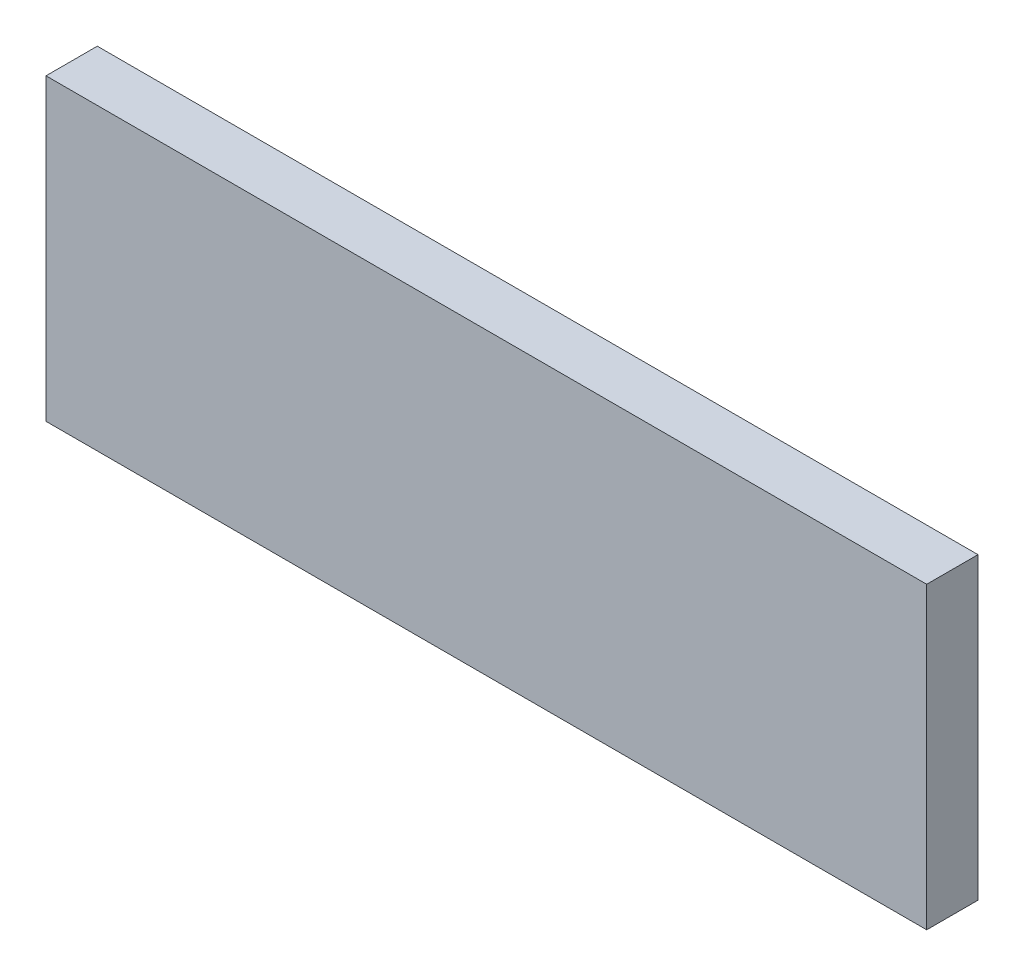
ISO-10303-21;
HEADER;
FILE_DESCRIPTION(('STEP AP214'),'2;1');
FILE_NAME('part.step','',(''),(''),'','','');
FILE_SCHEMA(('AUTOMOTIVE_DESIGN { 1 0 10303 214 1 1 1 1 }'));
ENDSEC;
DATA;
#1=APPLICATION_CONTEXT('core data for automotive mechanical design processes');
#2=APPLICATION_PROTOCOL_DEFINITION('international standard','automotive_design',2000,#1);
#3=PRODUCT_CONTEXT('',#1,'mechanical');
#4=PRODUCT('Part','Part','',(#3));
#5=PRODUCT_RELATED_PRODUCT_CATEGORY('part','',(#4));
#6=PRODUCT_DEFINITION_FORMATION('','',#4);
#7=PRODUCT_DEFINITION_CONTEXT('part definition',#1,'design');
#8=PRODUCT_DEFINITION('design','',#6,#7);
#9=PRODUCT_DEFINITION_SHAPE('','',#8);
#10=(LENGTH_UNIT() NAMED_UNIT(*) SI_UNIT(.MILLI.,.METRE.));
#11=(NAMED_UNIT(*) PLANE_ANGLE_UNIT() SI_UNIT($,.RADIAN.));
#12=(NAMED_UNIT(*) SI_UNIT($,.STERADIAN.) SOLID_ANGLE_UNIT());
#13=UNCERTAINTY_MEASURE_WITH_UNIT(LENGTH_MEASURE(1.E-05),#10,'distance_accuracy_value','');
#14=(GEOMETRIC_REPRESENTATION_CONTEXT(3) GLOBAL_UNCERTAINTY_ASSIGNED_CONTEXT((#13)) GLOBAL_UNIT_ASSIGNED_CONTEXT((#10,
#11,#12)) REPRESENTATION_CONTEXT('',''));
#15=CARTESIAN_POINT('',(0.,0.,0.));
#16=DIRECTION('',(0.,0.,1.));
#17=DIRECTION('',(1.,0.,0.));
#18=AXIS2_PLACEMENT_3D('',#15,#16,#17);
#19=CARTESIAN_POINT('',(-66.9469284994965,22.3688821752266,6.));
#20=DIRECTION('',(1.,0.,0.));
#21=DIRECTION('',(0.,0.,-1.));
#22=AXIS2_PLACEMENT_3D('',#19,#20,#21);
#23=PLANE('',#22);
#24=DIRECTION('',(0.,-1.,0.));
#25=VECTOR('',#24,1.);
#26=CARTESIAN_POINT('',(-66.9469284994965,22.3688821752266,0.));
#27=LINE('',#26,#25);
#28=CARTESIAN_POINT('',(-66.9469284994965,22.3688821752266,0.));
#29=VERTEX_POINT('',#28);
#30=CARTESIAN_POINT('',(-66.9469284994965,-12.6311178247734,0.));
#31=VERTEX_POINT('',#30);
#32=EDGE_CURVE('E78',#29,#31,#27,.T.);
#33=ORIENTED_EDGE('',*,*,#32,.T.);
#34=DIRECTION('',(0.,0.,-1.));
#35=VECTOR('',#34,1.);
#36=CARTESIAN_POINT('',(-66.9469284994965,-12.6311178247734,6.));
#37=LINE('',#36,#35);
#38=CARTESIAN_POINT('',(-66.9469284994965,-12.6311178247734,6.));
#39=VERTEX_POINT('',#38);
#40=EDGE_CURVE('E11',#39,#31,#37,.T.);
#41=ORIENTED_EDGE('',*,*,#40,.F.);
#42=DIRECTION('',(0.,-1.,0.));
#43=VECTOR('',#42,1.);
#44=CARTESIAN_POINT('',(-66.9469284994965,22.3688821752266,6.));
#45=LINE('',#44,#43);
#46=CARTESIAN_POINT('',(-66.9469284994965,22.3688821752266,6.));
#47=VERTEX_POINT('',#46);
#48=EDGE_CURVE('E96',#47,#39,#45,.T.);
#49=ORIENTED_EDGE('',*,*,#48,.F.);
#50=DIRECTION('',(0.,0.,-1.));
#51=VECTOR('',#50,1.);
#52=CARTESIAN_POINT('',(-66.9469284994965,22.3688821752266,6.));
#53=LINE('',#52,#51);
#54=EDGE_CURVE('E90',#47,#29,#53,.T.);
#55=ORIENTED_EDGE('',*,*,#54,.T.);
#56=EDGE_LOOP('',(#33,#41,#49,#55));
#57=FACE_BOUND('',#56,.T.);
#58=ADVANCED_FACE('F34',(#57),#23,.F.);
#59=CARTESIAN_POINT('',(-66.9469284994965,-12.6311178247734,6.));
#60=DIRECTION('',(0.,1.,0.));
#61=DIRECTION('',(0.,0.,1.));
#62=AXIS2_PLACEMENT_3D('',#59,#60,#61);
#63=PLANE('',#62);
#64=DIRECTION('',(1.,0.,0.));
#65=VECTOR('',#64,1.);
#66=CARTESIAN_POINT('',(-66.9469284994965,-12.6311178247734,0.));
#67=LINE('',#66,#65);
#68=CARTESIAN_POINT('',(36.0530715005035,-12.6311178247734,0.));
#69=VERTEX_POINT('',#68);
#70=EDGE_CURVE('E74',#31,#69,#67,.T.);
#71=ORIENTED_EDGE('',*,*,#70,.T.);
#72=DIRECTION('',(0.,0.,-1.));
#73=VECTOR('',#72,1.);
#74=CARTESIAN_POINT('',(36.0530715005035,-12.6311178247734,6.));
#75=LINE('',#74,#73);
#76=CARTESIAN_POINT('',(36.0530715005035,-12.6311178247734,6.));
#77=VERTEX_POINT('',#76);
#78=EDGE_CURVE('E41',#77,#69,#75,.T.);
#79=ORIENTED_EDGE('',*,*,#78,.F.);
#80=DIRECTION('',(1.,0.,0.));
#81=VECTOR('',#80,1.);
#82=CARTESIAN_POINT('',(-66.9469284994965,-12.6311178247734,6.));
#83=LINE('',#82,#81);
#84=EDGE_CURVE('E86',#39,#77,#83,.T.);
#85=ORIENTED_EDGE('',*,*,#84,.F.);
#86=ORIENTED_EDGE('',*,*,#40,.T.);
#87=EDGE_LOOP('',(#71,#79,#85,#86));
#88=FACE_BOUND('',#87,.T.);
#89=ADVANCED_FACE('F85',(#88),#63,.F.);
#90=CARTESIAN_POINT('',(36.0530715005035,22.3688821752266,6.));
#91=DIRECTION('',(-1.,0.,0.));
#92=DIRECTION('',(0.,-1.,0.));
#93=AXIS2_PLACEMENT_3D('',#90,#91,#92);
#94=PLANE('',#93);
#95=DIRECTION('',(0.,1.,0.));
#96=VECTOR('',#95,1.);
#97=CARTESIAN_POINT('',(36.0530715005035,22.3688821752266,0.));
#98=LINE('',#97,#96);
#99=CARTESIAN_POINT('',(36.0530715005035,22.3688821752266,0.));
#100=VERTEX_POINT('',#99);
#101=EDGE_CURVE('E79',#69,#100,#98,.T.);
#102=ORIENTED_EDGE('',*,*,#101,.T.);
#103=DIRECTION('',(0.,0.,-1.));
#104=VECTOR('',#103,1.);
#105=CARTESIAN_POINT('',(36.0530715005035,22.3688821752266,6.));
#106=LINE('',#105,#104);
#107=CARTESIAN_POINT('',(36.0530715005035,22.3688821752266,6.));
#108=VERTEX_POINT('',#107);
#109=EDGE_CURVE('E102',#108,#100,#106,.T.);
#110=ORIENTED_EDGE('',*,*,#109,.F.);
#111=DIRECTION('',(0.,1.,0.));
#112=VECTOR('',#111,1.);
#113=CARTESIAN_POINT('',(36.0530715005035,22.3688821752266,6.));
#114=LINE('',#113,#112);
#115=EDGE_CURVE('E53',#77,#108,#114,.T.);
#116=ORIENTED_EDGE('',*,*,#115,.F.);
#117=ORIENTED_EDGE('',*,*,#78,.T.);
#118=EDGE_LOOP('',(#102,#110,#116,#117));
#119=FACE_BOUND('',#118,.T.);
#120=ADVANCED_FACE('F105',(#119),#94,.F.);
#121=CARTESIAN_POINT('',(-66.9469284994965,22.3688821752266,6.));
#122=DIRECTION('',(0.,-1.,0.));
#123=DIRECTION('',(0.,0.,-1.));
#124=AXIS2_PLACEMENT_3D('',#121,#122,#123);
#125=PLANE('',#124);
#126=DIRECTION('',(-1.,0.,0.));
#127=VECTOR('',#126,1.);
#128=CARTESIAN_POINT('',(-66.9469284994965,22.3688821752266,0.));
#129=LINE('',#128,#127);
#130=EDGE_CURVE('E94',#100,#29,#129,.T.);
#131=ORIENTED_EDGE('',*,*,#130,.T.);
#132=ORIENTED_EDGE('',*,*,#54,.F.);
#133=DIRECTION('',(-1.,0.,0.));
#134=VECTOR('',#133,1.);
#135=CARTESIAN_POINT('',(-66.9469284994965,22.3688821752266,6.));
#136=LINE('',#135,#134);
#137=EDGE_CURVE('E48',#108,#47,#136,.T.);
#138=ORIENTED_EDGE('',*,*,#137,.F.);
#139=ORIENTED_EDGE('',*,*,#109,.T.);
#140=EDGE_LOOP('',(#131,#132,#138,#139));
#141=FACE_BOUND('',#140,.T.);
#142=ADVANCED_FACE('F107',(#141),#125,.F.);
#143=CARTESIAN_POINT('',(-66.9469284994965,-12.6311178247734,6.));
#144=DIRECTION('',(0.,0.,1.));
#145=DIRECTION('',(1.,0.,0.));
#146=AXIS2_PLACEMENT_3D('',#143,#144,#145);
#147=PLANE('',#146);
#148=ORIENTED_EDGE('',*,*,#48,.T.);
#149=ORIENTED_EDGE('',*,*,#84,.T.);
#150=ORIENTED_EDGE('',*,*,#115,.T.);
#151=ORIENTED_EDGE('',*,*,#137,.T.);
#152=EDGE_LOOP('',(#148,#149,#150,#151));
#153=FACE_BOUND('',#152,.T.);
#154=ADVANCED_FACE('F108',(#153),#147,.T.);
#155=CARTESIAN_POINT('',(-66.9469284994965,-12.6311178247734,0.));
#156=DIRECTION('',(0.,0.,1.));
#157=DIRECTION('',(1.,0.,0.));
#158=AXIS2_PLACEMENT_3D('',#155,#156,#157);
#159=PLANE('',#158);
#160=ORIENTED_EDGE('',*,*,#32,.F.);
#161=ORIENTED_EDGE('',*,*,#130,.F.);
#162=ORIENTED_EDGE('',*,*,#101,.F.);
#163=ORIENTED_EDGE('',*,*,#70,.F.);
#164=EDGE_LOOP('',(#160,#161,#162,#163));
#165=FACE_BOUND('',#164,.T.);
#166=ADVANCED_FACE('F75',(#165),#159,.F.);
#167=CLOSED_SHELL('',(#58,#89,#120,#142,#154,#166));
#168=MANIFOLD_SOLID_BREP('B2',#167);
#169=ADVANCED_BREP_SHAPE_REPRESENTATION('',(#18,#168),#14);
#170=SHAPE_DEFINITION_REPRESENTATION(#9,#169);
ENDSEC;
END-ISO-10303-21;
